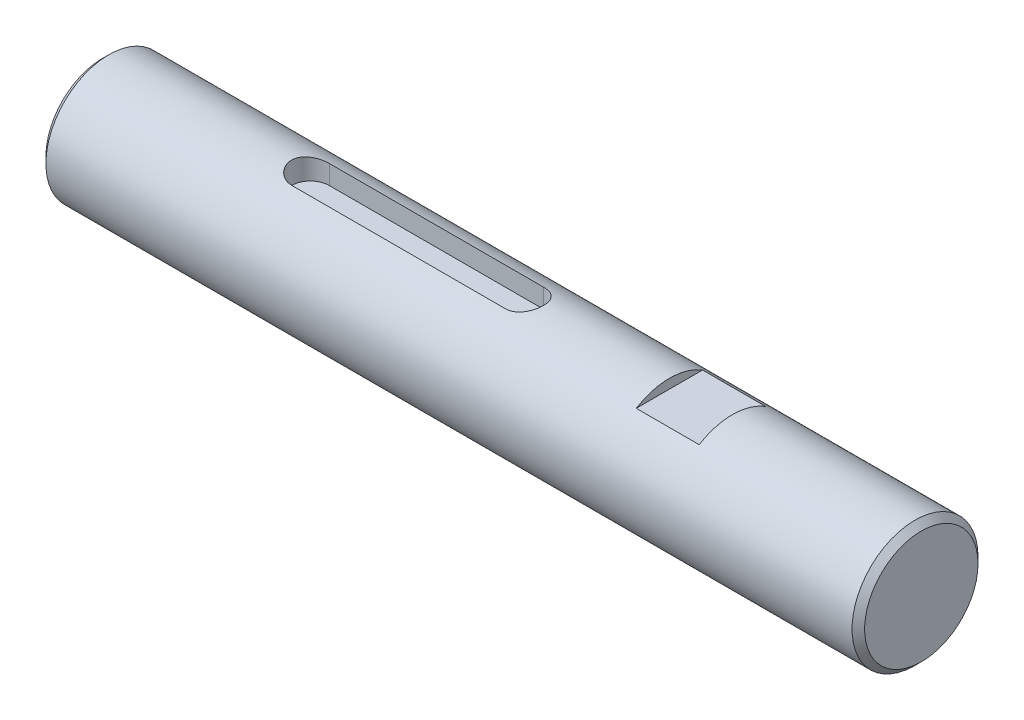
ISO-10303-21;
HEADER;
FILE_DESCRIPTION(('STEP AP214'),'2;1');
FILE_NAME('part.step','',(''),(''),'','','');
FILE_SCHEMA(('AUTOMOTIVE_DESIGN { 1 0 10303 214 1 1 1 1 }'));
ENDSEC;
DATA;
#1=APPLICATION_CONTEXT('core data for automotive mechanical design processes');
#2=APPLICATION_PROTOCOL_DEFINITION('international standard','automotive_design',2000,#1);
#3=PRODUCT_CONTEXT('',#1,'mechanical');
#4=PRODUCT('Part','Part','',(#3));
#5=PRODUCT_RELATED_PRODUCT_CATEGORY('part','',(#4));
#6=PRODUCT_DEFINITION_FORMATION('','',#4);
#7=PRODUCT_DEFINITION_CONTEXT('part definition',#1,'design');
#8=PRODUCT_DEFINITION('design','',#6,#7);
#9=PRODUCT_DEFINITION_SHAPE('','',#8);
#10=(LENGTH_UNIT() NAMED_UNIT(*) SI_UNIT(.MILLI.,.METRE.));
#11=(NAMED_UNIT(*) PLANE_ANGLE_UNIT() SI_UNIT($,.RADIAN.));
#12=(NAMED_UNIT(*) SI_UNIT($,.STERADIAN.) SOLID_ANGLE_UNIT());
#13=UNCERTAINTY_MEASURE_WITH_UNIT(LENGTH_MEASURE(1.E-05),#10,'distance_accuracy_value','');
#14=(GEOMETRIC_REPRESENTATION_CONTEXT(3) GLOBAL_UNCERTAINTY_ASSIGNED_CONTEXT((#13)) GLOBAL_UNIT_ASSIGNED_CONTEXT((#10,
#11,#12)) REPRESENTATION_CONTEXT('',''));
#15=CARTESIAN_POINT('',(0.,0.,0.));
#16=DIRECTION('',(0.,0.,1.));
#17=DIRECTION('',(1.,0.,0.));
#18=AXIS2_PLACEMENT_3D('',#15,#16,#17);
#19=CARTESIAN_POINT('',(-63.,6.5,0.));
#20=DIRECTION('',(0.,1.,0.));
#21=DIRECTION('',(0.,0.,1.));
#22=AXIS2_PLACEMENT_3D('',#19,#20,#21);
#23=CYLINDRICAL_SURFACE('',#22,3.);
#24=DIRECTION('',(0.,-1.,0.));
#25=VECTOR('',#24,1.);
#26=CARTESIAN_POINT('',(-63.,6.5,-3.));
#27=LINE('',#26,#25);
#28=CARTESIAN_POINT('',(-63.,6.5,-3.));
#29=VERTEX_POINT('',#28);
#30=CARTESIAN_POINT('',(-63.,9.53939201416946,-3.));
#31=VERTEX_POINT('',#30);
#32=EDGE_CURVE('E165',#29,#31,#27,.F.);
#33=ORIENTED_EDGE('',*,*,#32,.F.);
#34=CARTESIAN_POINT('',(-63.,6.5,0.));
#35=DIRECTION('',(0.,-1.,0.));
#36=DIRECTION('',(0.,0.,-1.));
#37=AXIS2_PLACEMENT_3D('',#34,#35,#36);
#38=CIRCLE('',#37,3.);
#39=CARTESIAN_POINT('',(-63.,6.5,3.));
#40=VERTEX_POINT('',#39);
#41=EDGE_CURVE('E57',#40,#29,#38,.F.);
#42=ORIENTED_EDGE('',*,*,#41,.F.);
#43=DIRECTION('',(0.,-1.,0.));
#44=VECTOR('',#43,1.);
#45=CARTESIAN_POINT('',(-63.,6.5,3.));
#46=LINE('',#45,#44);
#47=CARTESIAN_POINT('',(-63.,9.53939201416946,3.));
#48=VERTEX_POINT('',#47);
#49=EDGE_CURVE('E166',#48,#40,#46,.T.);
#50=ORIENTED_EDGE('',*,*,#49,.F.);
#51=CARTESIAN_POINT('',(-63.,9.53939201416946,-3.));
#52=CARTESIAN_POINT('',(-62.9176644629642,9.53938054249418,-3.00001027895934));
#53=CARTESIAN_POINT('',(-62.8353355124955,9.54045772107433,-2.9966106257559));
#54=CARTESIAN_POINT('',(-62.6713059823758,9.54470412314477,-2.98307142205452));
#55=CARTESIAN_POINT('',(-62.5896052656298,9.54787287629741,-2.97293338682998));
#56=CARTESIAN_POINT('',(-62.4276150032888,9.55620668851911,-2.94603139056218));
#57=CARTESIAN_POINT('',(-62.3473224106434,9.56136667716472,-2.92928425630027));
#58=CARTESIAN_POINT('',(-62.1885241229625,9.5735162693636,-2.88932851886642));
#59=CARTESIAN_POINT('',(-62.1100184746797,9.58050592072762,-2.866119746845));
#60=CARTESIAN_POINT('',(-61.8780481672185,9.60391662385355,-2.78708502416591));
#61=CARTESIAN_POINT('',(-61.72792681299,9.6227906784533,-2.72181653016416));
#62=CARTESIAN_POINT('',(-61.4407695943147,9.66493287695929,-2.56814755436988));
#63=CARTESIAN_POINT('',(-61.3037394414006,9.68820292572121,-2.47973703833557));
#64=CARTESIAN_POINT('',(-61.0422893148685,9.73733420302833,-2.27930849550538));
#65=CARTESIAN_POINT('',(-60.9183382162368,9.76325026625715,-2.166691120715));
#66=CARTESIAN_POINT('',(-60.690745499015,9.81429160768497,-1.92230070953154));
#67=CARTESIAN_POINT('',(-60.5871110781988,9.83941660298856,-1.7905209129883));
#68=CARTESIAN_POINT('',(-60.4010283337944,9.88667632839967,-1.50815545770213));
#69=CARTESIAN_POINT('',(-60.3190725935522,9.90873687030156,-1.35723196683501));
#70=CARTESIAN_POINT('',(-60.1819677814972,9.94670462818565,-1.04306867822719));
#71=CARTESIAN_POINT('',(-60.1267861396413,9.96261931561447,-0.879844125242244));
#72=CARTESIAN_POINT('',(-60.0574641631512,9.98287579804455,-0.596548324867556));
#73=CARTESIAN_POINT('',(-60.0359562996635,9.98926260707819,-0.47837382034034));
#74=CARTESIAN_POINT('',(-60.007221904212,9.99782637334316,-0.240148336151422));
#75=CARTESIAN_POINT('',(-59.9999948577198,10.0000034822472,-0.120097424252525));
#76=CARTESIAN_POINT('',(-60.0000070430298,9.99999523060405,0.164489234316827));
#77=CARTESIAN_POINT('',(-60.013580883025,9.99589991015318,0.329065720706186));
#78=CARTESIAN_POINT('',(-60.0674173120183,9.97995006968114,0.653490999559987));
#79=CARTESIAN_POINT('',(-60.1077037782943,9.9680886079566,0.813335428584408));
#80=CARTESIAN_POINT('',(-60.2134949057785,9.93791009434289,1.12347011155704));
#81=CARTESIAN_POINT('',(-60.2789560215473,9.91960419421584,1.27377634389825));
#82=CARTESIAN_POINT('',(-60.4330806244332,9.87844006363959,1.56126220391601));
#83=CARTESIAN_POINT('',(-60.5217449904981,9.85558166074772,1.69844133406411));
#84=CARTESIAN_POINT('',(-60.7224450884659,9.80701538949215,1.95973986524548));
#85=CARTESIAN_POINT('',(-60.8350262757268,9.78124908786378,2.08342941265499));
#86=CARTESIAN_POINT('',(-61.0792126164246,9.73011795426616,2.31049322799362));
#87=CARTESIAN_POINT('',(-61.210821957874,9.70475321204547,2.41386301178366));
#88=CARTESIAN_POINT('',(-61.4929838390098,9.65667462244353,2.59963060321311));
#89=CARTESIAN_POINT('',(-61.6438997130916,9.63403435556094,2.68149682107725));
#90=CARTESIAN_POINT('',(-61.9581009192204,9.59486058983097,2.81846673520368));
#91=CARTESIAN_POINT('',(-62.1213751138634,9.57832166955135,2.87359420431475));
#92=CARTESIAN_POINT('',(-62.4045395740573,9.5572566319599,2.94274437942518));
#93=CARTESIAN_POINT('',(-62.5225149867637,9.55060657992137,2.96417022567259));
#94=CARTESIAN_POINT('',(-62.760302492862,9.54165234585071,2.99281300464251));
#95=CARTESIAN_POINT('',(-62.8801140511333,9.53934692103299,3.00003400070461));
#96=CARTESIAN_POINT('',(-63.,9.53939201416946,3.));
#97=B_SPLINE_CURVE_WITH_KNOTS('',3,(#51,#52,#53,#54,#55,#56,#57,#58,#59,#60,#61,#62,#63,#64,#65,
#66,#67,#68,#69,#70,#71,#72,#73,#74,#75,#76,#77,#78,#79,#80,#81,#82,#83,#84,#85,#86,#87,#88,#89,
#90,#91,#92,#93,#94,#95,#96),.UNSPECIFIED.,.F.,.F.,(4,2,2,2,2,2,2,2,2,2,2,2,2,2,2,2,2,2,2,2,2,2,
4),(0.,0.24691819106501,0.493780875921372,0.740019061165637,0.986263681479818,1.4781412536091,
1.97023245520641,2.47630442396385,2.9825553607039,3.49947665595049,4.01576754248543,
4.37574541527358,4.73571031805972,5.22872964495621,5.72219025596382,6.21480112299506,
6.70743065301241,7.2128091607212,7.71829906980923,8.23530810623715,8.75185663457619,
9.11124123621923,9.4705230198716),.UNSPECIFIED.);
#98=EDGE_CURVE('E50',#48,#31,#97,.F.);
#99=ORIENTED_EDGE('',*,*,#98,.T.);
#100=EDGE_LOOP('',(#33,#42,#50,#99));
#101=FACE_BOUND('',#100,.T.);
#102=ADVANCED_FACE('F35',(#101),#23,.F.);
#103=CARTESIAN_POINT('',(-97.,9.53939201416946,0.));
#104=DIRECTION('',(0.,1.,0.));
#105=DIRECTION('',(0.,0.,1.));
#106=AXIS2_PLACEMENT_3D('',#103,#104,#105);
#107=CYLINDRICAL_SURFACE('',#106,3.);
#108=DIRECTION('',(0.,1.,0.));
#109=VECTOR('',#108,1.);
#110=CARTESIAN_POINT('',(-97.,9.53939201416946,-3.));
#111=LINE('',#110,#109);
#112=CARTESIAN_POINT('',(-97.,9.53939201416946,-3.));
#113=VERTEX_POINT('',#112);
#114=CARTESIAN_POINT('',(-97.,6.5,-3.));
#115=VERTEX_POINT('',#114);
#116=EDGE_CURVE('E121',#113,#115,#111,.F.);
#117=ORIENTED_EDGE('',*,*,#116,.F.);
#118=CARTESIAN_POINT('',(-97.,9.53939201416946,3.));
#119=CARTESIAN_POINT('',(-97.0823355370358,9.53938054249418,3.00001027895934));
#120=CARTESIAN_POINT('',(-97.1646644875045,9.54045772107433,2.9966106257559));
#121=CARTESIAN_POINT('',(-97.3286940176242,9.54470412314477,2.98307142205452));
#122=CARTESIAN_POINT('',(-97.4103947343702,9.54787287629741,2.97293338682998));
#123=CARTESIAN_POINT('',(-97.5723849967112,9.55620668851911,2.94603139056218));
#124=CARTESIAN_POINT('',(-97.6526775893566,9.56136667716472,2.92928425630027));
#125=CARTESIAN_POINT('',(-97.8114758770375,9.5735162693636,2.88932851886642));
#126=CARTESIAN_POINT('',(-97.8899815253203,9.58050592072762,2.866119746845));
#127=CARTESIAN_POINT('',(-98.1219518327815,9.60391662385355,2.78708502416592));
#128=CARTESIAN_POINT('',(-98.27207318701,9.62279067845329,2.72181653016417));
#129=CARTESIAN_POINT('',(-98.5592304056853,9.66493287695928,2.56814755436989));
#130=CARTESIAN_POINT('',(-98.6962605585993,9.6882029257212,2.47973703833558));
#131=CARTESIAN_POINT('',(-98.9577106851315,9.73733420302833,2.27930849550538));
#132=CARTESIAN_POINT('',(-99.0816617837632,9.76325026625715,2.166691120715));
#133=CARTESIAN_POINT('',(-99.309254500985,9.81429160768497,1.92230070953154));
#134=CARTESIAN_POINT('',(-99.4128889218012,9.83941660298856,1.79052091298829));
#135=CARTESIAN_POINT('',(-99.5989716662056,9.88667632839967,1.50815545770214));
#136=CARTESIAN_POINT('',(-99.6809274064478,9.90873687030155,1.35723196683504));
#137=CARTESIAN_POINT('',(-99.8180322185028,9.94670462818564,1.04306867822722));
#138=CARTESIAN_POINT('',(-99.8732138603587,9.96261931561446,0.879844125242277));
#139=CARTESIAN_POINT('',(-99.9425358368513,9.98287579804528,0.596548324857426));
#140=CARTESIAN_POINT('',(-99.9640437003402,9.9892626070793,0.478373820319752));
#141=CARTESIAN_POINT('',(-99.9927780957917,9.99782637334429,0.240148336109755));
#142=CARTESIAN_POINT('',(-100.000005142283,10.0000034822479,0.120097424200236));
#143=CARTESIAN_POINT('',(-99.9999929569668,9.99999523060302,-0.164489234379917));
#144=CARTESIAN_POINT('',(-99.986419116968,9.9958999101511,-0.329065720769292));
#145=CARTESIAN_POINT('',(-99.9325826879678,9.97995006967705,-0.653490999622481));
#146=CARTESIAN_POINT('',(-99.8922962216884,9.96808860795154,-0.813335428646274));
#147=CARTESIAN_POINT('',(-99.7865050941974,9.93791009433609,-1.12347011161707));
#148=CARTESIAN_POINT('',(-99.7210439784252,9.91960419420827,-1.27377634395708));
#149=CARTESIAN_POINT('',(-99.5669193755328,9.87844006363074,-1.5612622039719));
#150=CARTESIAN_POINT('',(-99.4782550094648,9.85558166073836,-1.69844133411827));
#151=CARTESIAN_POINT('',(-99.2775549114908,9.80701538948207,-1.95973986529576));
#152=CARTESIAN_POINT('',(-99.1649737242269,9.78124908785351,-2.08342941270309));
#153=CARTESIAN_POINT('',(-98.9207873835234,9.73011795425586,-2.31049322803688));
#154=CARTESIAN_POINT('',(-98.7891780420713,9.70475321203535,-2.41386301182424));
#155=CARTESIAN_POINT('',(-98.5070161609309,9.65667462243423,-2.59963060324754));
#156=CARTESIAN_POINT('',(-98.356100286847,9.63403435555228,-2.68149682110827));
#157=CARTESIAN_POINT('',(-98.0418990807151,9.59486058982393,-2.81846673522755));
#158=CARTESIAN_POINT('',(-97.8786248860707,9.57832166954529,-2.8735942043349));
#159=CARTESIAN_POINT('',(-97.5954604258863,9.5572566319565,-2.94274437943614));
#160=CARTESIAN_POINT('',(-97.4774850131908,9.55060657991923,-2.96417022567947));
#161=CARTESIAN_POINT('',(-97.2396975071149,9.54165234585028,-2.99281300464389));
#162=CARTESIAN_POINT('',(-97.1198859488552,9.539346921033,-3.00003400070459));
#163=CARTESIAN_POINT('',(-97.,9.53939201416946,-3.));
#164=B_SPLINE_CURVE_WITH_KNOTS('',3,(#118,#119,#120,#121,#122,#123,#124,#125,#126,#127,#128,
#129,#130,#131,#132,#133,#134,#135,#136,#137,#138,#139,#140,#141,#142,#143,#144,#145,#146,#147,
#148,#149,#150,#151,#152,#153,#154,#155,#156,#157,#158,#159,#160,#161,#162,#163),.UNSPECIFIED.,
.F.,.F.,(4,2,2,2,2,2,2,2,2,2,2,2,2,2,2,2,2,2,2,2,2,2,4),(0.,0.24691819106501,0.493780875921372,
0.740019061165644,0.986263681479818,1.47814125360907,1.9702324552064,2.47630442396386,
2.9825553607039,3.49947665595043,4.01576754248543,4.37574541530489,4.73571031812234,
5.22872964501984,5.72219025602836,6.21480112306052,6.70743065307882,7.21280916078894,
7.71829906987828,8.23530810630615,8.75185663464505,9.11124123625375,9.4705230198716),.UNSPECIFIED.);
#165=CARTESIAN_POINT('',(-97.,9.53939201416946,3.));
#166=VERTEX_POINT('',#165);
#167=EDGE_CURVE('E159',#113,#166,#164,.F.);
#168=ORIENTED_EDGE('',*,*,#167,.T.);
#169=DIRECTION('',(0.,1.,0.));
#170=VECTOR('',#169,1.);
#171=CARTESIAN_POINT('',(-97.,9.53939201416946,3.));
#172=LINE('',#171,#170);
#173=CARTESIAN_POINT('',(-97.,6.5,3.));
#174=VERTEX_POINT('',#173);
#175=EDGE_CURVE('E126',#174,#166,#172,.T.);
#176=ORIENTED_EDGE('',*,*,#175,.F.);
#177=CARTESIAN_POINT('',(-97.,6.5,0.));
#178=DIRECTION('',(0.,-1.,0.));
#179=DIRECTION('',(0.,0.,-1.));
#180=AXIS2_PLACEMENT_3D('',#177,#178,#179);
#181=CIRCLE('',#180,3.);
#182=EDGE_CURVE('E169',#115,#174,#181,.F.);
#183=ORIENTED_EDGE('',*,*,#182,.F.);
#184=EDGE_LOOP('',(#117,#168,#176,#183));
#185=FACE_BOUND('',#184,.T.);
#186=ADVANCED_FACE('F192',(#185),#107,.F.);
#187=CARTESIAN_POINT('',(-130.,0.,0.));
#188=DIRECTION('',(1.,0.,0.));
#189=DIRECTION('',(0.,0.,-1.));
#190=AXIS2_PLACEMENT_3D('',#187,#188,#189);
#191=CYLINDRICAL_SURFACE('',#190,10.);
#192=CARTESIAN_POINT('',(-1.,0.,0.));
#193=DIRECTION('',(1.,0.,0.));
#194=DIRECTION('',(0.,0.,-1.));
#195=AXIS2_PLACEMENT_3D('',#192,#193,#194);
#196=CIRCLE('',#195,10.);
#197=CARTESIAN_POINT('',(-1.,0.,-10.));
#198=VERTEX_POINT('',#197);
#199=EDGE_CURVE('E43',#198,#198,#196,.F.);
#200=ORIENTED_EDGE('',*,*,#199,.T.);
#201=EDGE_LOOP('',(#200));
#202=FACE_BOUND('',#201,.T.);
#203=CARTESIAN_POINT('',(-129.,0.,0.));
#204=DIRECTION('',(1.,0.,0.));
#205=DIRECTION('',(0.,0.,-1.));
#206=AXIS2_PLACEMENT_3D('',#203,#204,#205);
#207=CIRCLE('',#206,10.);
#208=CARTESIAN_POINT('',(-129.,0.,-10.));
#209=VERTEX_POINT('',#208);
#210=EDGE_CURVE('E249',#209,#209,#207,.T.);
#211=ORIENTED_EDGE('',*,*,#210,.T.);
#212=EDGE_LOOP('',(#211));
#213=FACE_BOUND('',#212,.T.);
#214=ORIENTED_EDGE('',*,*,#98,.F.);
#215=DIRECTION('',(1.,0.,0.));
#216=VECTOR('',#215,1.);
#217=CARTESIAN_POINT('',(-100.,9.53939201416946,3.));
#218=LINE('',#217,#216);
#219=EDGE_CURVE('E149',#166,#48,#218,.T.);
#220=ORIENTED_EDGE('',*,*,#219,.F.);
#221=ORIENTED_EDGE('',*,*,#167,.F.);
#222=DIRECTION('',(1.,0.,0.));
#223=VECTOR('',#222,1.);
#224=CARTESIAN_POINT('',(-100.,9.53939201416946,-3.));
#225=LINE('',#224,#223);
#226=EDGE_CURVE('E146',#113,#31,#225,.T.);
#227=ORIENTED_EDGE('',*,*,#226,.T.);
#228=EDGE_LOOP('',(#214,#220,#221,#227));
#229=FACE_BOUND('',#228,.T.);
#230=DIRECTION('',(1.,0.,0.));
#231=VECTOR('',#230,1.);
#232=CARTESIAN_POINT('',(-40.,8.5,5.26782687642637));
#233=LINE('',#232,#231);
#234=CARTESIAN_POINT('',(-40.,8.5,5.26782687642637));
#235=VERTEX_POINT('',#234);
#236=CARTESIAN_POINT('',(-30.,8.5,5.26782687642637));
#237=VERTEX_POINT('',#236);
#238=EDGE_CURVE('E135',#235,#237,#233,.T.);
#239=ORIENTED_EDGE('',*,*,#238,.F.);
#240=CARTESIAN_POINT('',(-40.,0.,0.));
#241=DIRECTION('',(1.,0.,0.));
#242=DIRECTION('',(0.,0.,-1.));
#243=AXIS2_PLACEMENT_3D('',#240,#241,#242);
#244=CIRCLE('',#243,10.);
#245=CARTESIAN_POINT('',(-40.,8.5,-5.26782687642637));
#246=VERTEX_POINT('',#245);
#247=EDGE_CURVE('E124',#235,#246,#244,.F.);
#248=ORIENTED_EDGE('',*,*,#247,.T.);
#249=DIRECTION('',(1.,0.,0.));
#250=VECTOR('',#249,1.);
#251=CARTESIAN_POINT('',(-40.,8.5,-5.26782687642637));
#252=LINE('',#251,#250);
#253=CARTESIAN_POINT('',(-30.,8.5,-5.26782687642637));
#254=VERTEX_POINT('',#253);
#255=EDGE_CURVE('E139',#246,#254,#252,.T.);
#256=ORIENTED_EDGE('',*,*,#255,.T.);
#257=CARTESIAN_POINT('',(-30.,0.,0.));
#258=DIRECTION('',(1.,0.,0.));
#259=DIRECTION('',(0.,0.,-1.));
#260=AXIS2_PLACEMENT_3D('',#257,#258,#259);
#261=CIRCLE('',#260,10.);
#262=EDGE_CURVE('E129',#237,#254,#261,.F.);
#263=ORIENTED_EDGE('',*,*,#262,.F.);
#264=EDGE_LOOP('',(#239,#248,#256,#263));
#265=FACE_BOUND('',#264,.T.);
#266=DIRECTION('',(1.,0.,0.));
#267=VECTOR('',#266,1.);
#268=CARTESIAN_POINT('',(-40.,-8.5,5.26782687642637));
#269=LINE('',#268,#267);
#270=CARTESIAN_POINT('',(-40.,-8.5,5.26782687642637));
#271=VERTEX_POINT('',#270);
#272=CARTESIAN_POINT('',(-30.,-8.5,5.26782687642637));
#273=VERTEX_POINT('',#272);
#274=EDGE_CURVE('E101',#271,#273,#269,.T.);
#275=ORIENTED_EDGE('',*,*,#274,.T.);
#276=CARTESIAN_POINT('',(-30.,-8.5,-5.26782687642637));
#277=VERTEX_POINT('',#276);
#278=EDGE_CURVE('E122',#277,#273,#261,.F.);
#279=ORIENTED_EDGE('',*,*,#278,.F.);
#280=DIRECTION('',(1.,0.,0.));
#281=VECTOR('',#280,1.);
#282=CARTESIAN_POINT('',(-40.,-8.5,-5.26782687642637));
#283=LINE('',#282,#281);
#284=CARTESIAN_POINT('',(-40.,-8.5,-5.26782687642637));
#285=VERTEX_POINT('',#284);
#286=EDGE_CURVE('E112',#285,#277,#283,.T.);
#287=ORIENTED_EDGE('',*,*,#286,.F.);
#288=EDGE_CURVE('E117',#285,#271,#244,.F.);
#289=ORIENTED_EDGE('',*,*,#288,.T.);
#290=EDGE_LOOP('',(#275,#279,#287,#289));
#291=FACE_BOUND('',#290,.T.);
#292=ADVANCED_FACE('F120',(#202,#213,#229,#265,#291),#191,.T.);
#293=CARTESIAN_POINT('',(-130.,0.,0.));
#294=DIRECTION('',(1.,0.,0.));
#295=DIRECTION('',(0.,0.,-1.));
#296=AXIS2_PLACEMENT_3D('',#293,#294,#295);
#297=PLANE('',#296);
#298=CARTESIAN_POINT('',(-130.,0.,0.));
#299=DIRECTION('',(1.,0.,0.));
#300=DIRECTION('',(0.,0.,-1.));
#301=AXIS2_PLACEMENT_3D('',#298,#299,#300);
#302=CIRCLE('',#301,8.99999999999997);
#303=CARTESIAN_POINT('',(-130.,0.,-8.99999999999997));
#304=VERTEX_POINT('',#303);
#305=EDGE_CURVE('E12',#304,#304,#302,.F.);
#306=ORIENTED_EDGE('',*,*,#305,.T.);
#307=EDGE_LOOP('',(#306));
#308=FACE_BOUND('',#307,.T.);
#309=ADVANCED_FACE('F191',(#308),#297,.F.);
#310=CARTESIAN_POINT('',(0.,0.,0.));
#311=DIRECTION('',(1.,0.,0.));
#312=DIRECTION('',(0.,0.,-1.));
#313=AXIS2_PLACEMENT_3D('',#310,#311,#312);
#314=PLANE('',#313);
#315=CARTESIAN_POINT('',(0.,0.,0.));
#316=DIRECTION('',(1.,0.,0.));
#317=DIRECTION('',(0.,0.,-1.));
#318=AXIS2_PLACEMENT_3D('',#315,#316,#317);
#319=CIRCLE('',#318,9.00000000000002);
#320=CARTESIAN_POINT('',(0.,0.,-9.00000000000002));
#321=VERTEX_POINT('',#320);
#322=EDGE_CURVE('E184',#321,#321,#319,.T.);
#323=ORIENTED_EDGE('',*,*,#322,.T.);
#324=EDGE_LOOP('',(#323));
#325=FACE_BOUND('',#324,.T.);
#326=ADVANCED_FACE('F194',(#325),#314,.T.);
#327=CARTESIAN_POINT('',(-40.,-8.5,-5.26782687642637));
#328=DIRECTION('',(0.,-1.,0.));
#329=DIRECTION('',(0.,0.,-1.));
#330=AXIS2_PLACEMENT_3D('',#327,#328,#329);
#331=PLANE('',#330);
#332=DIRECTION('',(0.,0.,-1.));
#333=VECTOR('',#332,1.);
#334=CARTESIAN_POINT('',(-30.,-8.5,-5.26782687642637));
#335=LINE('',#334,#333);
#336=EDGE_CURVE('E107',#273,#277,#335,.T.);
#337=ORIENTED_EDGE('',*,*,#336,.F.);
#338=ORIENTED_EDGE('',*,*,#274,.F.);
#339=DIRECTION('',(0.,0.,-1.));
#340=VECTOR('',#339,1.);
#341=CARTESIAN_POINT('',(-40.,-8.5,-5.26782687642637));
#342=LINE('',#341,#340);
#343=EDGE_CURVE('E104',#271,#285,#342,.T.);
#344=ORIENTED_EDGE('',*,*,#343,.T.);
#345=ORIENTED_EDGE('',*,*,#286,.T.);
#346=EDGE_LOOP('',(#337,#338,#344,#345));
#347=FACE_BOUND('',#346,.T.);
#348=ADVANCED_FACE('F103',(#347),#331,.T.);
#349=CARTESIAN_POINT('',(-30.,0.,0.));
#350=DIRECTION('',(1.,0.,0.));
#351=DIRECTION('',(0.,0.,-1.));
#352=AXIS2_PLACEMENT_3D('',#349,#350,#351);
#353=PLANE('',#352);
#354=ORIENTED_EDGE('',*,*,#278,.T.);
#355=ORIENTED_EDGE('',*,*,#336,.T.);
#356=EDGE_LOOP('',(#354,#355));
#357=FACE_BOUND('',#356,.T.);
#358=ADVANCED_FACE('F231',(#357),#353,.F.);
#359=CARTESIAN_POINT('',(-40.,0.,0.));
#360=DIRECTION('',(1.,0.,0.));
#361=DIRECTION('',(0.,0.,-1.));
#362=AXIS2_PLACEMENT_3D('',#359,#360,#361);
#363=PLANE('',#362);
#364=ORIENTED_EDGE('',*,*,#343,.F.);
#365=ORIENTED_EDGE('',*,*,#288,.F.);
#366=EDGE_LOOP('',(#364,#365));
#367=FACE_BOUND('',#366,.T.);
#368=ADVANCED_FACE('F116',(#367),#363,.T.);
#369=DIRECTION('',(0.,0.,1.));
#370=VECTOR('',#369,1.);
#371=CARTESIAN_POINT('',(-40.,8.5,5.26782687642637));
#372=LINE('',#371,#370);
#373=EDGE_CURVE('E113',#246,#235,#372,.T.);
#374=ORIENTED_EDGE('',*,*,#373,.F.);
#375=ORIENTED_EDGE('',*,*,#247,.F.);
#376=EDGE_LOOP('',(#374,#375));
#377=FACE_BOUND('',#376,.T.);
#378=ADVANCED_FACE('F232',(#377),#363,.T.);
#379=ORIENTED_EDGE('',*,*,#262,.T.);
#380=DIRECTION('',(0.,0.,1.));
#381=VECTOR('',#380,1.);
#382=CARTESIAN_POINT('',(-30.,8.5,5.26782687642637));
#383=LINE('',#382,#381);
#384=EDGE_CURVE('E118',#254,#237,#383,.T.);
#385=ORIENTED_EDGE('',*,*,#384,.T.);
#386=EDGE_LOOP('',(#379,#385));
#387=FACE_BOUND('',#386,.T.);
#388=ADVANCED_FACE('F227',(#387),#353,.F.);
#389=CARTESIAN_POINT('',(-40.,8.5,5.26782687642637));
#390=DIRECTION('',(0.,1.,0.));
#391=DIRECTION('',(0.,0.,1.));
#392=AXIS2_PLACEMENT_3D('',#389,#390,#391);
#393=PLANE('',#392);
#394=ORIENTED_EDGE('',*,*,#384,.F.);
#395=ORIENTED_EDGE('',*,*,#255,.F.);
#396=ORIENTED_EDGE('',*,*,#373,.T.);
#397=ORIENTED_EDGE('',*,*,#238,.T.);
#398=EDGE_LOOP('',(#394,#395,#396,#397));
#399=FACE_BOUND('',#398,.T.);
#400=ADVANCED_FACE('F222',(#399),#393,.T.);
#401=CARTESIAN_POINT('',(-100.,9.53939201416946,-3.));
#402=DIRECTION('',(0.,0.,-1.));
#403=DIRECTION('',(0.,1.,0.));
#404=AXIS2_PLACEMENT_3D('',#401,#402,#403);
#405=PLANE('',#404);
#406=DIRECTION('',(1.,0.,0.));
#407=VECTOR('',#406,1.);
#408=CARTESIAN_POINT('',(-100.,6.5,-3.));
#409=LINE('',#408,#407);
#410=EDGE_CURVE('E155',#115,#29,#409,.T.);
#411=ORIENTED_EDGE('',*,*,#410,.T.);
#412=ORIENTED_EDGE('',*,*,#32,.T.);
#413=ORIENTED_EDGE('',*,*,#226,.F.);
#414=ORIENTED_EDGE('',*,*,#116,.T.);
#415=EDGE_LOOP('',(#411,#412,#413,#414));
#416=FACE_BOUND('',#415,.T.);
#417=ADVANCED_FACE('F163',(#416),#405,.F.);
#418=CARTESIAN_POINT('',(-100.,6.5,3.));
#419=DIRECTION('',(0.,-1.,0.));
#420=DIRECTION('',(0.,0.,-1.));
#421=AXIS2_PLACEMENT_3D('',#418,#419,#420);
#422=PLANE('',#421);
#423=DIRECTION('',(1.,0.,0.));
#424=VECTOR('',#423,1.);
#425=CARTESIAN_POINT('',(-100.,6.5,3.));
#426=LINE('',#425,#424);
#427=EDGE_CURVE('E152',#174,#40,#426,.T.);
#428=ORIENTED_EDGE('',*,*,#427,.T.);
#429=ORIENTED_EDGE('',*,*,#41,.T.);
#430=ORIENTED_EDGE('',*,*,#410,.F.);
#431=ORIENTED_EDGE('',*,*,#182,.T.);
#432=EDGE_LOOP('',(#428,#429,#430,#431));
#433=FACE_BOUND('',#432,.T.);
#434=ADVANCED_FACE('F213',(#433),#422,.F.);
#435=CARTESIAN_POINT('',(-100.,9.53939201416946,3.));
#436=DIRECTION('',(0.,0.,1.));
#437=DIRECTION('',(0.,-1.,0.));
#438=AXIS2_PLACEMENT_3D('',#435,#436,#437);
#439=PLANE('',#438);
#440=ORIENTED_EDGE('',*,*,#219,.T.);
#441=ORIENTED_EDGE('',*,*,#49,.T.);
#442=ORIENTED_EDGE('',*,*,#427,.F.);
#443=ORIENTED_EDGE('',*,*,#175,.T.);
#444=EDGE_LOOP('',(#440,#441,#442,#443));
#445=FACE_BOUND('',#444,.T.);
#446=ADVANCED_FACE('F212',(#445),#439,.F.);
#447=CARTESIAN_POINT('',(0.,0.,0.));
#448=DIRECTION('',(-1.,0.,0.));
#449=DIRECTION('',(0.,0.,1.));
#450=AXIS2_PLACEMENT_3D('',#447,#448,#449);
#451=CONICAL_SURFACE('',#450,9.00000000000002,0.785398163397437);
#452=ORIENTED_EDGE('',*,*,#199,.F.);
#453=EDGE_LOOP('',(#452));
#454=FACE_BOUND('',#453,.T.);
#455=ORIENTED_EDGE('',*,*,#322,.F.);
#456=EDGE_LOOP('',(#455));
#457=FACE_BOUND('',#456,.T.);
#458=ADVANCED_FACE('F220',(#454,#457),#451,.T.);
#459=CARTESIAN_POINT('',(-129.,0.,0.));
#460=DIRECTION('',(1.,0.,0.));
#461=DIRECTION('',(0.,0.,-1.));
#462=AXIS2_PLACEMENT_3D('',#459,#460,#461);
#463=CONICAL_SURFACE('',#462,10.,0.785398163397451);
#464=ORIENTED_EDGE('',*,*,#305,.F.);
#465=EDGE_LOOP('',(#464));
#466=FACE_BOUND('',#465,.T.);
#467=ORIENTED_EDGE('',*,*,#210,.F.);
#468=EDGE_LOOP('',(#467));
#469=FACE_BOUND('',#468,.T.);
#470=ADVANCED_FACE('F37',(#466,#469),#463,.T.);
#471=CLOSED_SHELL('',(#102,#186,#292,#309,#326,#348,#358,#368,#378,#388,#400,#417,#434,#446,
#458,#470));
#472=MANIFOLD_SOLID_BREP('B2',#471);
#473=ADVANCED_BREP_SHAPE_REPRESENTATION('',(#18,#472),#14);
#474=SHAPE_DEFINITION_REPRESENTATION(#9,#473);
ENDSEC;
END-ISO-10303-21;
